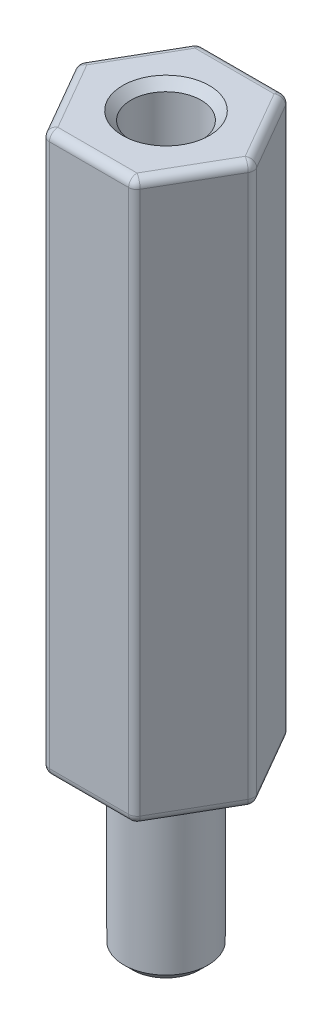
from build123d import *

# Parameters (mm, degrees)
SKETCH1_R           = 1.25
BOSS_EXTRUDE1_DEPTH = 20
FILLET1_R           = 0.3
FILLET2_R           = 0.3
SKETCH2_R           = 1.5
BOSS_EXTRUDE2_DEPTH = 6
CHAMFER1_SIZE       = 0.3
FILLET3_R           = 0.3


with BuildPart() as part:
    # Sketch1 → Boss-Extrude1 (new body)
    with BuildSketch(Plane(origin=(0, 0, 0), x_dir=(1, 0, 0), z_dir=(0, 1, 0))):
        Polygon((-1.58771324, 2.75), (-3.175426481, 0), (-1.58771324, -2.75), (1.58771324, -2.75), (3.175426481, 0), (1.58771324, 2.75), align=None)
        with Locations(Location((0, 0, 0), (0, 0, 270))):
            Circle(SKETCH1_R, mode=Mode.SUBTRACT)
    extrude(amount=BOSS_EXTRUDE1_DEPTH)

    # Fillet1
    fillet1_edges = [part.edges().sort_by_distance(p)[0] for p in [
        (1.58771324, 10, -2.75),
        (3.175426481, 10, 0),
        (1.58771324, 10, 2.75),
        (-1.58771324, 10, 2.75),
        (-3.175426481, 10, 0),
        (-1.58771324, 10, -2.75),
    ]]
    fillet(fillet1_edges, radius=FILLET1_R)

    # Fillet2
    fillet2_edges = [part.edges().sort_by_distance(p)[0] for p in [
        (0, 0, -2.75),
        (0, 20, -2.75),
        (2.38156986, 0, -1.375),
        (2.38156986, 0, 1.375),
        (0, 0, 2.75),
        (-2.38156986, 0, 1.375),
        (-2.38156986, 0, -1.375),
        (1.56450816, 0, 2.709807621),
        (-1.56450816, 0, 2.709807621),
        (-3.129016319, 0, 0),
        (-1.56450816, 0, -2.709807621),
        (3.129016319, 0, 0),
        (1.56450816, 0, -2.709807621),
        (2.38156986, 20, -1.375),
        (-2.38156986, 20, -1.375),
        (-2.38156986, 20, 1.375),
        (0, 20, 2.75),
        (2.38156986, 20, 1.375),
        (1.56450816, 20, 2.709807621),
        (-1.56450816, 20, 2.709807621),
        (-3.129016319, 20, 0),
        (-1.56450816, 20, -2.709807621),
        (3.129016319, 20, 0),
        (1.56450816, 20, -2.709807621),
    ]]
    fillet(fillet2_edges, radius=FILLET2_R)

    # Sketch2 → Boss-Extrude2 (add)
    with BuildSketch(Plane.XZ):
        with Locations(Location((0, 0, 0), (0, 0, 90))):
            Circle(SKETCH2_R)
    extrude(amount=BOSS_EXTRUDE2_DEPTH)

    # Chamfer1
    chamfer1_edges = [part.edges().sort_by_distance(p)[0] for p in [
        (0, -6, -1.5),
        (0, 20, -1.25),
    ]]
    chamfer(chamfer1_edges, length=CHAMFER1_SIZE)

    # Fillet3
    fillet3_edges = [part.edges().sort_by_distance(p)[0] for p in [
        (0, 0, -1.5),
    ]]
    fillet(fillet3_edges, radius=FILLET3_R)


solid = part.part
